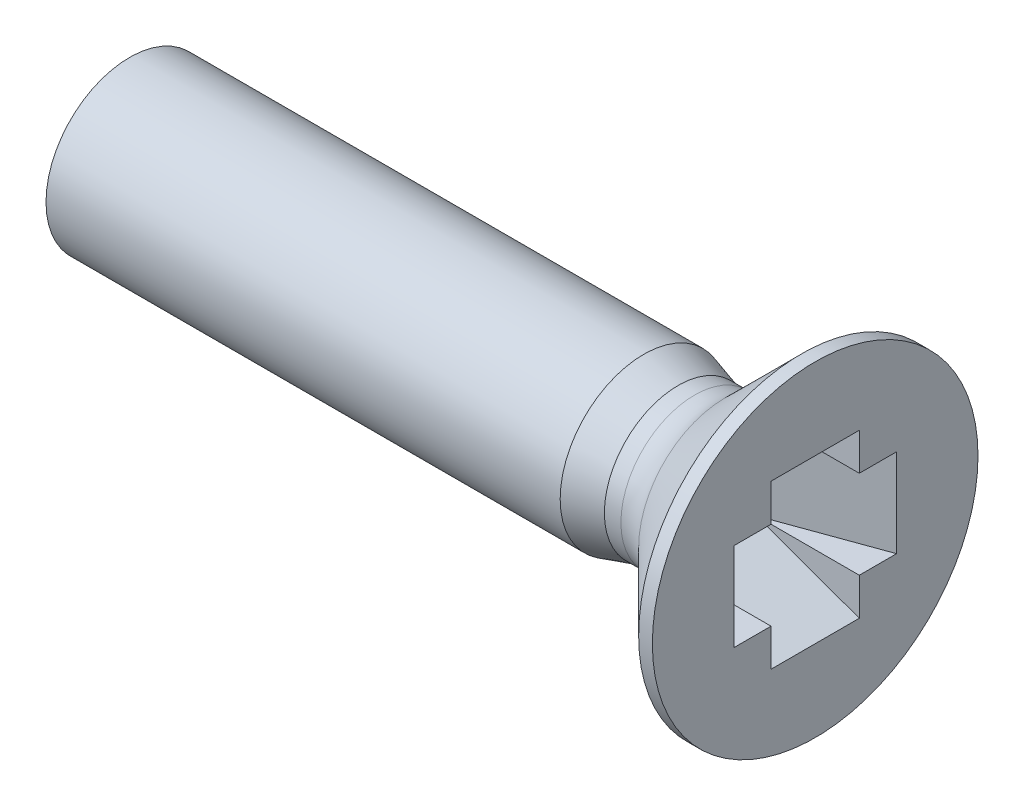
ISO-10303-21;
HEADER;
FILE_DESCRIPTION(('STEP AP214'),'2;1');
FILE_NAME('part.step','',(''),(''),'','','');
FILE_SCHEMA(('AUTOMOTIVE_DESIGN { 1 0 10303 214 1 1 1 1 }'));
ENDSEC;
DATA;
#1=APPLICATION_CONTEXT('core data for automotive mechanical design processes');
#2=APPLICATION_PROTOCOL_DEFINITION('international standard','automotive_design',2000,#1);
#3=PRODUCT_CONTEXT('',#1,'mechanical');
#4=PRODUCT('Part','Part','',(#3));
#5=PRODUCT_RELATED_PRODUCT_CATEGORY('part','',(#4));
#6=PRODUCT_DEFINITION_FORMATION('','',#4);
#7=PRODUCT_DEFINITION_CONTEXT('part definition',#1,'design');
#8=PRODUCT_DEFINITION('design','',#6,#7);
#9=PRODUCT_DEFINITION_SHAPE('','',#8);
#10=(LENGTH_UNIT() NAMED_UNIT(*) SI_UNIT(.MILLI.,.METRE.));
#11=(NAMED_UNIT(*) PLANE_ANGLE_UNIT() SI_UNIT($,.RADIAN.));
#12=(NAMED_UNIT(*) SI_UNIT($,.STERADIAN.) SOLID_ANGLE_UNIT());
#13=UNCERTAINTY_MEASURE_WITH_UNIT(LENGTH_MEASURE(1.E-05),#10,'distance_accuracy_value','');
#14=(GEOMETRIC_REPRESENTATION_CONTEXT(3) GLOBAL_UNCERTAINTY_ASSIGNED_CONTEXT((#13)) GLOBAL_UNIT_ASSIGNED_CONTEXT((#10,
#11,#12)) REPRESENTATION_CONTEXT('',''));
#15=CARTESIAN_POINT('',(0.,0.,0.));
#16=DIRECTION('',(0.,0.,1.));
#17=DIRECTION('',(1.,0.,0.));
#18=AXIS2_PLACEMENT_3D('',#15,#16,#17);
#19=CARTESIAN_POINT('',(0.,-0.949999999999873,-0.515));
#20=DIRECTION('',(0.,0.,1.));
#21=DIRECTION('',(1.,0.,0.));
#22=AXIS2_PLACEMENT_3D('',#19,#20,#21);
#23=PLANE('',#22);
#24=DIRECTION('',(0.,1.,0.));
#25=VECTOR('',#24,1.);
#26=CARTESIAN_POINT('',(0.,-0.949999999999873,-0.515));
#27=LINE('',#26,#25);
#28=CARTESIAN_POINT('',(0.,-0.949999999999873,-0.515));
#29=VERTEX_POINT('',#28);
#30=CARTESIAN_POINT('',(0.,-0.515,-0.515));
#31=VERTEX_POINT('',#30);
#32=EDGE_CURVE('E135',#29,#31,#27,.T.);
#33=ORIENTED_EDGE('',*,*,#32,.T.);
#34=DIRECTION('',(-1.,0.,0.));
#35=VECTOR('',#34,1.);
#36=CARTESIAN_POINT('',(0.,-0.515,-0.515));
#37=LINE('',#36,#35);
#38=CARTESIAN_POINT('',(-1.2,-0.515,-0.515));
#39=VERTEX_POINT('',#38);
#40=EDGE_CURVE('E271',#31,#39,#37,.T.);
#41=ORIENTED_EDGE('',*,*,#40,.T.);
#42=DIRECTION('',(0.940136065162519,-0.340799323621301,0.));
#43=VECTOR('',#42,1.);
#44=CARTESIAN_POINT('',(-1.2,-0.515,-0.515));
#45=LINE('',#44,#43);
#46=EDGE_CURVE('E157',#39,#29,#45,.T.);
#47=ORIENTED_EDGE('',*,*,#46,.T.);
#48=EDGE_LOOP('',(#33,#41,#47));
#49=FACE_BOUND('',#48,.T.);
#50=ADVANCED_FACE('F30',(#49),#23,.T.);
#51=CARTESIAN_POINT('',(0.,1.9,0.));
#52=DIRECTION('',(1.,0.,0.));
#53=DIRECTION('',(0.,0.,-1.));
#54=AXIS2_PLACEMENT_3D('',#51,#52,#53);
#55=PLANE('',#54);
#56=DIRECTION('',(0.,0.,1.));
#57=VECTOR('',#56,1.);
#58=CARTESIAN_POINT('',(0.,0.515,-0.949999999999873));
#59=LINE('',#58,#57);
#60=CARTESIAN_POINT('',(0.,0.515,-0.949999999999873));
#61=VERTEX_POINT('',#60);
#62=CARTESIAN_POINT('',(0.,0.515,-0.515));
#63=VERTEX_POINT('',#62);
#64=EDGE_CURVE('E108',#61,#63,#59,.T.);
#65=ORIENTED_EDGE('',*,*,#64,.F.);
#66=DIRECTION('',(0.,-1.,0.));
#67=VECTOR('',#66,1.);
#68=CARTESIAN_POINT('',(0.,0.515,-0.949999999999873));
#69=LINE('',#68,#67);
#70=CARTESIAN_POINT('',(0.,-0.515,-0.949999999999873));
#71=VERTEX_POINT('',#70);
#72=EDGE_CURVE('E105',#61,#71,#69,.T.);
#73=ORIENTED_EDGE('',*,*,#72,.T.);
#74=DIRECTION('',(0.,0.,1.));
#75=VECTOR('',#74,1.);
#76=CARTESIAN_POINT('',(0.,-0.515,-0.949999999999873));
#77=LINE('',#76,#75);
#78=EDGE_CURVE('E117',#71,#31,#77,.T.);
#79=ORIENTED_EDGE('',*,*,#78,.T.);
#80=ORIENTED_EDGE('',*,*,#32,.F.);
#81=DIRECTION('',(0.,0.,1.));
#82=VECTOR('',#81,1.);
#83=CARTESIAN_POINT('',(0.,-0.949999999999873,-0.515));
#84=LINE('',#83,#82);
#85=CARTESIAN_POINT('',(0.,-0.949999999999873,0.515));
#86=VERTEX_POINT('',#85);
#87=EDGE_CURVE('E141',#29,#86,#84,.T.);
#88=ORIENTED_EDGE('',*,*,#87,.T.);
#89=DIRECTION('',(0.,1.,0.));
#90=VECTOR('',#89,1.);
#91=CARTESIAN_POINT('',(0.,-0.949999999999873,0.515));
#92=LINE('',#91,#90);
#93=CARTESIAN_POINT('',(0.,-0.515,0.515));
#94=VERTEX_POINT('',#93);
#95=EDGE_CURVE('E151',#86,#94,#92,.T.);
#96=ORIENTED_EDGE('',*,*,#95,.T.);
#97=DIRECTION('',(0.,0.,1.));
#98=VECTOR('',#97,1.);
#99=CARTESIAN_POINT('',(0.,-0.515,0.515000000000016));
#100=LINE('',#99,#98);
#101=CARTESIAN_POINT('',(0.,-0.515,0.95));
#102=VERTEX_POINT('',#101);
#103=EDGE_CURVE('E45',#94,#102,#100,.T.);
#104=ORIENTED_EDGE('',*,*,#103,.T.);
#105=DIRECTION('',(0.,-1.,0.));
#106=VECTOR('',#105,1.);
#107=CARTESIAN_POINT('',(0.,0.515,0.95));
#108=LINE('',#107,#106);
#109=CARTESIAN_POINT('',(0.,0.515,0.95));
#110=VERTEX_POINT('',#109);
#111=EDGE_CURVE('E150',#110,#102,#108,.T.);
#112=ORIENTED_EDGE('',*,*,#111,.F.);
#113=DIRECTION('',(0.,0.,1.));
#114=VECTOR('',#113,1.);
#115=CARTESIAN_POINT('',(0.,0.515,0.515000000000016));
#116=LINE('',#115,#114);
#117=CARTESIAN_POINT('',(0.,0.515,0.515000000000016));
#118=VERTEX_POINT('',#117);
#119=EDGE_CURVE('E254',#118,#110,#116,.T.);
#120=ORIENTED_EDGE('',*,*,#119,.F.);
#121=CARTESIAN_POINT('',(0.,0.95,0.515));
#122=VERTEX_POINT('',#121);
#123=EDGE_CURVE('E53',#118,#122,#92,.T.);
#124=ORIENTED_EDGE('',*,*,#123,.T.);
#125=DIRECTION('',(0.,0.,1.));
#126=VECTOR('',#125,1.);
#127=CARTESIAN_POINT('',(0.,0.95,-0.515));
#128=LINE('',#127,#126);
#129=CARTESIAN_POINT('',(0.,0.95,-0.515));
#130=VERTEX_POINT('',#129);
#131=EDGE_CURVE('E131',#130,#122,#128,.T.);
#132=ORIENTED_EDGE('',*,*,#131,.F.);
#133=EDGE_CURVE('E134',#63,#130,#27,.T.);
#134=ORIENTED_EDGE('',*,*,#133,.F.);
#135=EDGE_LOOP('',(#65,#73,#79,#80,#88,#96,#104,#112,#120,#124,#132,#134));
#136=FACE_BOUND('',#135,.T.);
#137=CARTESIAN_POINT('',(0.,0.,0.));
#138=DIRECTION('',(-1.,0.,0.));
#139=DIRECTION('',(0.,0.,1.));
#140=AXIS2_PLACEMENT_3D('',#137,#138,#139);
#141=CIRCLE('',#140,1.9);
#142=CARTESIAN_POINT('',(0.,0.,1.9));
#143=VERTEX_POINT('',#142);
#144=EDGE_CURVE('E172',#143,#143,#141,.T.);
#145=ORIENTED_EDGE('',*,*,#144,.F.);
#146=EDGE_LOOP('',(#145));
#147=FACE_BOUND('',#146,.T.);
#148=ADVANCED_FACE('F190',(#136,#147),#55,.T.);
#149=CARTESIAN_POINT('',(0.,-0.949999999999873,0.515));
#150=DIRECTION('',(0.,0.,1.));
#151=DIRECTION('',(1.,0.,0.));
#152=AXIS2_PLACEMENT_3D('',#149,#150,#151);
#153=PLANE('',#152);
#154=DIRECTION('',(1.,0.,0.));
#155=VECTOR('',#154,1.);
#156=CARTESIAN_POINT('',(-1.20000000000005,0.515,0.515000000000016));
#157=LINE('',#156,#155);
#158=CARTESIAN_POINT('',(-1.20000000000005,0.515,0.515000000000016));
#159=VERTEX_POINT('',#158);
#160=EDGE_CURVE('E251',#159,#118,#157,.T.);
#161=ORIENTED_EDGE('',*,*,#160,.F.);
#162=DIRECTION('',(-0.940136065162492,-0.340799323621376,0.));
#163=VECTOR('',#162,1.);
#164=CARTESIAN_POINT('',(0.,0.95,0.515));
#165=LINE('',#164,#163);
#166=EDGE_CURVE('E127',#122,#159,#165,.T.);
#167=ORIENTED_EDGE('',*,*,#166,.F.);
#168=ORIENTED_EDGE('',*,*,#123,.F.);
#169=EDGE_LOOP('',(#161,#167,#168));
#170=FACE_BOUND('',#169,.T.);
#171=ADVANCED_FACE('F196',(#170),#153,.F.);
#172=CARTESIAN_POINT('',(0.,0.,0.));
#173=DIRECTION('',(-1.,0.,0.));
#174=DIRECTION('',(0.,0.,1.));
#175=AXIS2_PLACEMENT_3D('',#172,#173,#174);
#176=CYLINDRICAL_SURFACE('',#175,1.9);
#177=ORIENTED_EDGE('',*,*,#144,.T.);
#178=EDGE_LOOP('',(#177));
#179=FACE_BOUND('',#178,.T.);
#180=CARTESIAN_POINT('',(-0.160000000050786,0.,0.));
#181=DIRECTION('',(-1.,0.,0.));
#182=DIRECTION('',(0.,0.,1.));
#183=AXIS2_PLACEMENT_3D('',#180,#181,#182);
#184=CIRCLE('',#183,1.9);
#185=CARTESIAN_POINT('',(-0.160000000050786,0.,1.9));
#186=VERTEX_POINT('',#185);
#187=EDGE_CURVE('E158',#186,#186,#184,.T.);
#188=ORIENTED_EDGE('',*,*,#187,.F.);
#189=EDGE_LOOP('',(#188));
#190=FACE_BOUND('',#189,.T.);
#191=ADVANCED_FACE('F235',(#179,#190),#176,.T.);
#192=CARTESIAN_POINT('',(-8.,0.,0.));
#193=DIRECTION('',(-1.,0.,0.));
#194=DIRECTION('',(0.,0.,1.));
#195=AXIS2_PLACEMENT_3D('',#192,#193,#194);
#196=PLANE('',#195);
#197=CARTESIAN_POINT('',(-8.,0.,0.));
#198=DIRECTION('',(-1.,0.,0.));
#199=DIRECTION('',(0.,0.,1.));
#200=AXIS2_PLACEMENT_3D('',#197,#198,#199);
#201=CIRCLE('',#200,0.975609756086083);
#202=CARTESIAN_POINT('',(-8.,0.,0.975609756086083));
#203=VERTEX_POINT('',#202);
#204=EDGE_CURVE('E169',#203,#203,#201,.T.);
#205=ORIENTED_EDGE('',*,*,#204,.T.);
#206=EDGE_LOOP('',(#205));
#207=FACE_BOUND('',#206,.T.);
#208=ADVANCED_FACE('F232',(#207),#196,.T.);
#209=CARTESIAN_POINT('',(0.,0.,0.));
#210=DIRECTION('',(-1.,0.,0.));
#211=DIRECTION('',(0.,0.,1.));
#212=AXIS2_PLACEMENT_3D('',#209,#210,#211);
#213=CYLINDRICAL_SURFACE('',#212,0.975609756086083);
#214=CARTESIAN_POINT('',(-2.00000000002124,0.,0.));
#215=DIRECTION('',(-1.,0.,0.));
#216=DIRECTION('',(0.,0.,1.));
#217=AXIS2_PLACEMENT_3D('',#214,#215,#216);
#218=CIRCLE('',#217,0.975609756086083);
#219=CARTESIAN_POINT('',(-2.00000000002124,0.,0.975609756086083));
#220=VERTEX_POINT('',#219);
#221=EDGE_CURVE('E166',#220,#220,#218,.T.);
#222=ORIENTED_EDGE('',*,*,#221,.T.);
#223=EDGE_LOOP('',(#222));
#224=FACE_BOUND('',#223,.T.);
#225=ORIENTED_EDGE('',*,*,#204,.F.);
#226=EDGE_LOOP('',(#225));
#227=FACE_BOUND('',#226,.T.);
#228=ADVANCED_FACE('F228',(#224,#227),#213,.T.);
#229=CARTESIAN_POINT('',(-2.00000000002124,0.,0.));
#230=DIRECTION('',(-1.,0.,0.));
#231=DIRECTION('',(0.,0.,1.));
#232=AXIS2_PLACEMENT_3D('',#229,#230,#231);
#233=CONICAL_SURFACE('',#232,0.975609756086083,0.281357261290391);
#234=CARTESIAN_POINT('',(-1.60000000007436,0.,0.));
#235=DIRECTION('',(-1.,0.,0.));
#236=DIRECTION('',(0.,0.,1.));
#237=AXIS2_PLACEMENT_3D('',#234,#235,#236);
#238=CIRCLE('',#237,0.860000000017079);
#239=CARTESIAN_POINT('',(-1.60000000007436,0.,0.860000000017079));
#240=VERTEX_POINT('',#239);
#241=EDGE_CURVE('E163',#240,#240,#238,.T.);
#242=ORIENTED_EDGE('',*,*,#241,.T.);
#243=EDGE_LOOP('',(#242));
#244=FACE_BOUND('',#243,.T.);
#245=ORIENTED_EDGE('',*,*,#221,.F.);
#246=EDGE_LOOP('',(#245));
#247=FACE_BOUND('',#246,.T.);
#248=ADVANCED_FACE('F225',(#244,#247),#233,.T.);
#249=CARTESIAN_POINT('',(0.,0.,0.));
#250=DIRECTION('',(-1.,0.,0.));
#251=DIRECTION('',(0.,0.,1.));
#252=AXIS2_PLACEMENT_3D('',#249,#250,#251);
#253=CYLINDRICAL_SURFACE('',#252,0.860000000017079);
#254=CARTESIAN_POINT('',(-1.40710678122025,0.,0.));
#255=DIRECTION('',(-1.,0.,0.));
#256=DIRECTION('',(0.,0.,1.));
#257=AXIS2_PLACEMENT_3D('',#254,#255,#256);
#258=CIRCLE('',#257,0.860000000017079);
#259=CARTESIAN_POINT('',(-1.40710678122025,0.,0.860000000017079));
#260=VERTEX_POINT('',#259);
#261=EDGE_CURVE('E38',#260,#260,#258,.T.);
#262=ORIENTED_EDGE('',*,*,#261,.T.);
#263=EDGE_LOOP('',(#262));
#264=FACE_BOUND('',#263,.T.);
#265=ORIENTED_EDGE('',*,*,#241,.F.);
#266=EDGE_LOOP('',(#265));
#267=FACE_BOUND('',#266,.T.);
#268=ADVANCED_FACE('F177',(#264,#267),#253,.T.);
#269=CARTESIAN_POINT('',(-1.20000000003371,0.,0.));
#270=DIRECTION('',(1.,0.,0.));
#271=DIRECTION('',(0.,0.,-1.));
#272=AXIS2_PLACEMENT_3D('',#269,#270,#271);
#273=CONICAL_SURFACE('',#272,0.860000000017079,0.785398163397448);
#274=CARTESIAN_POINT('',(-1.05355339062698,0.,0.));
#275=DIRECTION('',(1.,0.,0.));
#276=DIRECTION('',(0.,0.,-1.));
#277=AXIS2_PLACEMENT_3D('',#274,#275,#276);
#278=CIRCLE('',#277,1.00644660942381);
#279=CARTESIAN_POINT('',(-1.05355339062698,0.,-1.00644660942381));
#280=VERTEX_POINT('',#279);
#281=EDGE_CURVE('E11',#280,#280,#278,.T.);
#282=ORIENTED_EDGE('',*,*,#281,.T.);
#283=EDGE_LOOP('',(#282));
#284=FACE_BOUND('',#283,.T.);
#285=ORIENTED_EDGE('',*,*,#187,.T.);
#286=EDGE_LOOP('',(#285));
#287=FACE_BOUND('',#286,.T.);
#288=ADVANCED_FACE('F218',(#284,#287),#273,.T.);
#289=CARTESIAN_POINT('',(-1.2,-0.515,-0.515));
#290=DIRECTION('',(-0.340799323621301,-0.940136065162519,0.));
#291=DIRECTION('',(0.940136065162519,-0.340799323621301,0.));
#292=AXIS2_PLACEMENT_3D('',#289,#290,#291);
#293=PLANE('',#292);
#294=DIRECTION('',(0.940136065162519,-0.340799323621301,0.));
#295=VECTOR('',#294,1.);
#296=CARTESIAN_POINT('',(-1.2,-0.515,0.515));
#297=LINE('',#296,#295);
#298=CARTESIAN_POINT('',(-1.20000000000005,-0.515,0.515000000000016));
#299=VERTEX_POINT('',#298);
#300=EDGE_CURVE('E147',#299,#86,#297,.T.);
#301=ORIENTED_EDGE('',*,*,#300,.T.);
#302=ORIENTED_EDGE('',*,*,#87,.F.);
#303=ORIENTED_EDGE('',*,*,#46,.F.);
#304=DIRECTION('',(0.,0.,1.));
#305=VECTOR('',#304,1.);
#306=CARTESIAN_POINT('',(-1.2,-0.515,-0.515));
#307=LINE('',#306,#305);
#308=EDGE_CURVE('E130',#39,#299,#307,.T.);
#309=ORIENTED_EDGE('',*,*,#308,.T.);
#310=EDGE_LOOP('',(#301,#302,#303,#309));
#311=FACE_BOUND('',#310,.T.);
#312=ADVANCED_FACE('F213',(#311),#293,.F.);
#313=CARTESIAN_POINT('',(-1.20000000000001,0.515000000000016,-0.515));
#314=DIRECTION('',(-1.,0.,0.));
#315=DIRECTION('',(0.,-1.,0.));
#316=AXIS2_PLACEMENT_3D('',#313,#314,#315);
#317=PLANE('',#316);
#318=DIRECTION('',(0.,-1.,0.));
#319=VECTOR('',#318,1.);
#320=CARTESIAN_POINT('',(-1.20000000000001,0.515000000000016,0.515));
#321=LINE('',#320,#319);
#322=EDGE_CURVE('E155',#159,#299,#321,.T.);
#323=ORIENTED_EDGE('',*,*,#322,.T.);
#324=ORIENTED_EDGE('',*,*,#308,.F.);
#325=DIRECTION('',(0.,-1.,0.));
#326=VECTOR('',#325,1.);
#327=CARTESIAN_POINT('',(-1.20000000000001,0.515000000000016,-0.515));
#328=LINE('',#327,#326);
#329=CARTESIAN_POINT('',(-1.20000000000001,0.515,-0.515));
#330=VERTEX_POINT('',#329);
#331=EDGE_CURVE('E102',#330,#39,#328,.T.);
#332=ORIENTED_EDGE('',*,*,#331,.F.);
#333=DIRECTION('',(0.,0.,1.));
#334=VECTOR('',#333,1.);
#335=CARTESIAN_POINT('',(-1.20000000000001,0.515000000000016,-0.515));
#336=LINE('',#335,#334);
#337=EDGE_CURVE('E123',#330,#159,#336,.T.);
#338=ORIENTED_EDGE('',*,*,#337,.T.);
#339=EDGE_LOOP('',(#323,#324,#332,#338));
#340=FACE_BOUND('',#339,.T.);
#341=ADVANCED_FACE('F138',(#340),#317,.F.);
#342=CARTESIAN_POINT('',(0.,0.95,-0.515));
#343=DIRECTION('',(-0.340799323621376,0.940136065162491,0.));
#344=DIRECTION('',(-0.940136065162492,-0.340799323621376,0.));
#345=AXIS2_PLACEMENT_3D('',#342,#343,#344);
#346=PLANE('',#345);
#347=ORIENTED_EDGE('',*,*,#166,.T.);
#348=ORIENTED_EDGE('',*,*,#337,.F.);
#349=DIRECTION('',(-0.940136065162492,-0.340799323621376,0.));
#350=VECTOR('',#349,1.);
#351=CARTESIAN_POINT('',(0.,0.95,-0.515));
#352=LINE('',#351,#350);
#353=EDGE_CURVE('E126',#130,#330,#352,.T.);
#354=ORIENTED_EDGE('',*,*,#353,.F.);
#355=ORIENTED_EDGE('',*,*,#131,.T.);
#356=EDGE_LOOP('',(#347,#348,#354,#355));
#357=FACE_BOUND('',#356,.T.);
#358=ADVANCED_FACE('F124',(#357),#346,.F.);
#359=DIRECTION('',(-1.,0.,0.));
#360=VECTOR('',#359,1.);
#361=CARTESIAN_POINT('',(0.,0.515,-0.515));
#362=LINE('',#361,#360);
#363=EDGE_CURVE('E109',#63,#330,#362,.T.);
#364=ORIENTED_EDGE('',*,*,#363,.F.);
#365=ORIENTED_EDGE('',*,*,#133,.T.);
#366=ORIENTED_EDGE('',*,*,#353,.T.);
#367=EDGE_LOOP('',(#364,#365,#366));
#368=FACE_BOUND('',#367,.T.);
#369=ADVANCED_FACE('F133',(#368),#23,.T.);
#370=ORIENTED_EDGE('',*,*,#300,.F.);
#371=DIRECTION('',(1.,0.,0.));
#372=VECTOR('',#371,1.);
#373=CARTESIAN_POINT('',(-1.20000000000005,-0.515,0.515000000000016));
#374=LINE('',#373,#372);
#375=EDGE_CURVE('E265',#299,#94,#374,.T.);
#376=ORIENTED_EDGE('',*,*,#375,.T.);
#377=ORIENTED_EDGE('',*,*,#95,.F.);
#378=EDGE_LOOP('',(#370,#376,#377));
#379=FACE_BOUND('',#378,.T.);
#380=ADVANCED_FACE('F202',(#379),#153,.F.);
#381=CARTESIAN_POINT('',(0.,0.515,0.95));
#382=DIRECTION('',(-0.340799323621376,0.,0.940136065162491));
#383=DIRECTION('',(0.940136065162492,0.,0.340799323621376));
#384=AXIS2_PLACEMENT_3D('',#381,#382,#383);
#385=PLANE('',#384);
#386=DIRECTION('',(-0.940136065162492,0.,-0.340799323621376));
#387=VECTOR('',#386,1.);
#388=CARTESIAN_POINT('',(0.,-0.515,0.95));
#389=LINE('',#388,#387);
#390=EDGE_CURVE('E255',#102,#299,#389,.T.);
#391=ORIENTED_EDGE('',*,*,#390,.T.);
#392=ORIENTED_EDGE('',*,*,#322,.F.);
#393=DIRECTION('',(-0.940136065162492,0.,-0.340799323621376));
#394=VECTOR('',#393,1.);
#395=CARTESIAN_POINT('',(0.,0.515,0.95));
#396=LINE('',#395,#394);
#397=EDGE_CURVE('E257',#110,#159,#396,.T.);
#398=ORIENTED_EDGE('',*,*,#397,.F.);
#399=ORIENTED_EDGE('',*,*,#111,.T.);
#400=EDGE_LOOP('',(#391,#392,#398,#399));
#401=FACE_BOUND('',#400,.T.);
#402=ADVANCED_FACE('F207',(#401),#385,.F.);
#403=CARTESIAN_POINT('',(0.,0.515,0.515000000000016));
#404=DIRECTION('',(0.,-1.,0.));
#405=DIRECTION('',(0.,0.,-1.));
#406=AXIS2_PLACEMENT_3D('',#403,#404,#405);
#407=PLANE('',#406);
#408=ORIENTED_EDGE('',*,*,#160,.T.);
#409=ORIENTED_EDGE('',*,*,#119,.T.);
#410=ORIENTED_EDGE('',*,*,#397,.T.);
#411=EDGE_LOOP('',(#408,#409,#410));
#412=FACE_BOUND('',#411,.T.);
#413=ADVANCED_FACE('F282',(#412),#407,.T.);
#414=CARTESIAN_POINT('',(0.,-0.515,0.515000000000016));
#415=DIRECTION('',(0.,-1.,0.));
#416=DIRECTION('',(0.,0.,-1.));
#417=AXIS2_PLACEMENT_3D('',#414,#415,#416);
#418=PLANE('',#417);
#419=ORIENTED_EDGE('',*,*,#375,.F.);
#420=ORIENTED_EDGE('',*,*,#390,.F.);
#421=ORIENTED_EDGE('',*,*,#103,.F.);
#422=EDGE_LOOP('',(#419,#420,#421));
#423=FACE_BOUND('',#422,.T.);
#424=ADVANCED_FACE('F283',(#423),#418,.F.);
#425=CARTESIAN_POINT('',(-1.20000000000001,0.515,-0.515));
#426=DIRECTION('',(-0.340799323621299,0.,-0.940136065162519));
#427=DIRECTION('',(-0.940136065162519,0.,0.340799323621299));
#428=AXIS2_PLACEMENT_3D('',#425,#426,#427);
#429=PLANE('',#428);
#430=DIRECTION('',(0.940136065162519,0.,-0.340799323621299));
#431=VECTOR('',#430,1.);
#432=CARTESIAN_POINT('',(-1.20000000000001,-0.515,-0.515));
#433=LINE('',#432,#431);
#434=EDGE_CURVE('E274',#39,#71,#433,.T.);
#435=ORIENTED_EDGE('',*,*,#434,.T.);
#436=ORIENTED_EDGE('',*,*,#72,.F.);
#437=DIRECTION('',(0.940136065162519,0.,-0.340799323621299));
#438=VECTOR('',#437,1.);
#439=CARTESIAN_POINT('',(-1.20000000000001,0.515,-0.515));
#440=LINE('',#439,#438);
#441=EDGE_CURVE('E98',#330,#61,#440,.T.);
#442=ORIENTED_EDGE('',*,*,#441,.F.);
#443=ORIENTED_EDGE('',*,*,#331,.T.);
#444=EDGE_LOOP('',(#435,#436,#442,#443));
#445=FACE_BOUND('',#444,.T.);
#446=ADVANCED_FACE('F100',(#445),#429,.F.);
#447=CARTESIAN_POINT('',(0.,0.515,-0.515));
#448=DIRECTION('',(0.,1.,0.));
#449=DIRECTION('',(0.,0.,1.));
#450=AXIS2_PLACEMENT_3D('',#447,#448,#449);
#451=PLANE('',#450);
#452=ORIENTED_EDGE('',*,*,#363,.T.);
#453=ORIENTED_EDGE('',*,*,#441,.T.);
#454=ORIENTED_EDGE('',*,*,#64,.T.);
#455=EDGE_LOOP('',(#452,#453,#454));
#456=FACE_BOUND('',#455,.T.);
#457=ADVANCED_FACE('F113',(#456),#451,.F.);
#458=CARTESIAN_POINT('',(0.,-0.515,-0.515));
#459=DIRECTION('',(0.,1.,0.));
#460=DIRECTION('',(0.,0.,1.));
#461=AXIS2_PLACEMENT_3D('',#458,#459,#460);
#462=PLANE('',#461);
#463=ORIENTED_EDGE('',*,*,#40,.F.);
#464=ORIENTED_EDGE('',*,*,#78,.F.);
#465=ORIENTED_EDGE('',*,*,#434,.F.);
#466=EDGE_LOOP('',(#463,#464,#465));
#467=FACE_BOUND('',#466,.T.);
#468=ADVANCED_FACE('F181',(#467),#462,.T.);
#469=CARTESIAN_POINT('',(-1.40710678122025,0.,0.));
#470=DIRECTION('',(-1.,0.,0.));
#471=DIRECTION('',(0.,0.,1.));
#472=AXIS2_PLACEMENT_3D('',#469,#470,#471);
#473=TOROIDAL_SURFACE('',#472,1.36000000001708,0.5);
#474=ORIENTED_EDGE('',*,*,#281,.F.);
#475=EDGE_LOOP('',(#474));
#476=FACE_BOUND('',#475,.T.);
#477=ORIENTED_EDGE('',*,*,#261,.F.);
#478=EDGE_LOOP('',(#477));
#479=FACE_BOUND('',#478,.T.);
#480=ADVANCED_FACE('F32',(#476,#479),#473,.F.);
#481=CLOSED_SHELL('',(#50,#148,#171,#191,#208,#228,#248,#268,#288,#312,#341,#358,#369,#380,#402,
#413,#424,#446,#457,#468,#480));
#482=MANIFOLD_SOLID_BREP('B2',#481);
#483=ADVANCED_BREP_SHAPE_REPRESENTATION('',(#18,#482),#14);
#484=SHAPE_DEFINITION_REPRESENTATION(#9,#483);
ENDSEC;
END-ISO-10303-21;
